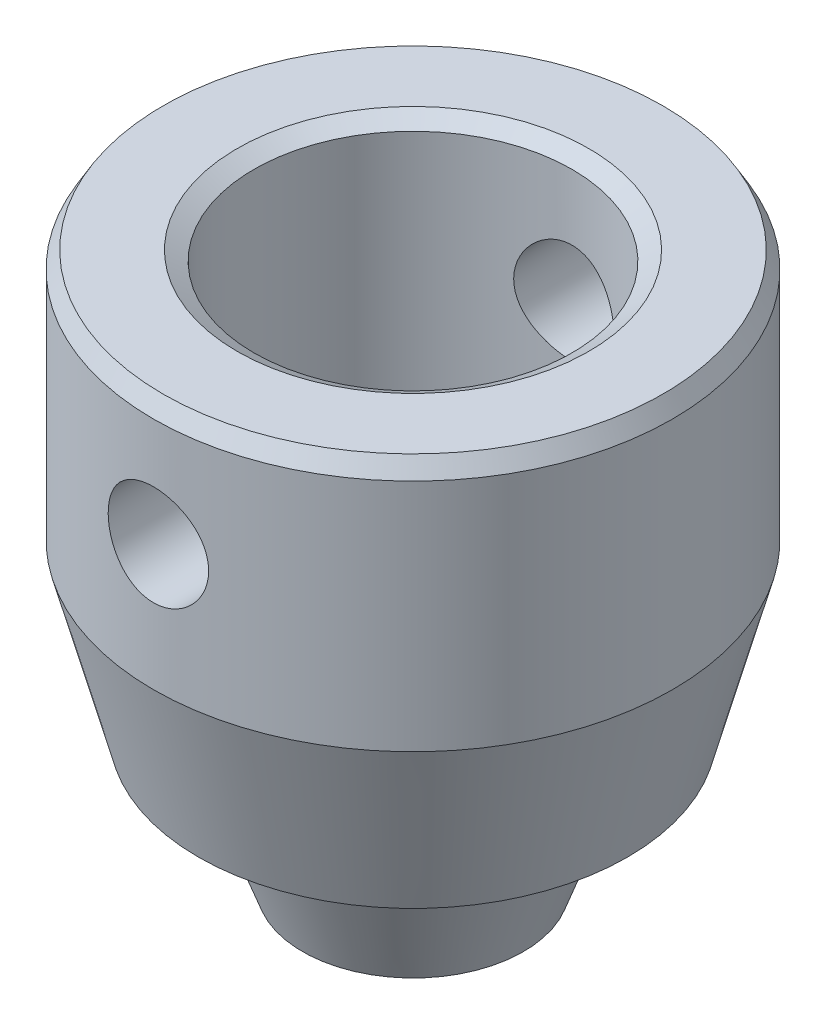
ISO-10303-21;
HEADER;
FILE_DESCRIPTION(('STEP AP214'),'2;1');
FILE_NAME('part.step','',(''),(''),'','','');
FILE_SCHEMA(('AUTOMOTIVE_DESIGN { 1 0 10303 214 1 1 1 1 }'));
ENDSEC;
DATA;
#1=APPLICATION_CONTEXT('core data for automotive mechanical design processes');
#2=APPLICATION_PROTOCOL_DEFINITION('international standard','automotive_design',2000,#1);
#3=PRODUCT_CONTEXT('',#1,'mechanical');
#4=PRODUCT('Part','Part','',(#3));
#5=PRODUCT_RELATED_PRODUCT_CATEGORY('part','',(#4));
#6=PRODUCT_DEFINITION_FORMATION('','',#4);
#7=PRODUCT_DEFINITION_CONTEXT('part definition',#1,'design');
#8=PRODUCT_DEFINITION('design','',#6,#7);
#9=PRODUCT_DEFINITION_SHAPE('','',#8);
#10=(LENGTH_UNIT() NAMED_UNIT(*) SI_UNIT(.MILLI.,.METRE.));
#11=(NAMED_UNIT(*) PLANE_ANGLE_UNIT() SI_UNIT($,.RADIAN.));
#12=(NAMED_UNIT(*) SI_UNIT($,.STERADIAN.) SOLID_ANGLE_UNIT());
#13=UNCERTAINTY_MEASURE_WITH_UNIT(LENGTH_MEASURE(1.E-05),#10,'distance_accuracy_value','');
#14=(GEOMETRIC_REPRESENTATION_CONTEXT(3) GLOBAL_UNCERTAINTY_ASSIGNED_CONTEXT((#13)) GLOBAL_UNIT_ASSIGNED_CONTEXT((#10,
#11,#12)) REPRESENTATION_CONTEXT('',''));
#15=CARTESIAN_POINT('',(0.,0.,0.));
#16=DIRECTION('',(0.,0.,1.));
#17=DIRECTION('',(1.,0.,0.));
#18=AXIS2_PLACEMENT_3D('',#15,#16,#17);
#19=CARTESIAN_POINT('',(0.,25.,0.));
#20=DIRECTION('',(0.,-1.,0.));
#21=DIRECTION('',(0.,0.,-1.));
#22=AXIS2_PLACEMENT_3D('',#19,#20,#21);
#23=CYLINDRICAL_SURFACE('',#22,15.5);
#24=CARTESIAN_POINT('',(0.,20.5,-15.5));
#25=CARTESIAN_POINT('',(-0.166842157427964,20.4999937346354,-15.4999969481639));
#26=CARTESIAN_POINT('',(-0.333764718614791,20.4860348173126,-15.4972784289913));
#27=CARTESIAN_POINT('',(-0.662899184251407,20.4306079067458,-15.4866958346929));
#28=CARTESIAN_POINT('',(-0.825107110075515,20.3891173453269,-15.4788275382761));
#29=CARTESIAN_POINT('',(-1.14000531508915,20.2799507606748,-15.4588248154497));
#30=CARTESIAN_POINT('',(-1.29270428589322,20.2122990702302,-15.4466943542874));
#31=CARTESIAN_POINT('',(-1.58457198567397,20.052801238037,-15.4194891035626));
#32=CARTESIAN_POINT('',(-1.72374167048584,19.9609568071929,-15.4044145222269));
#33=CARTESIAN_POINT('',(-1.9863833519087,19.7544409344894,-15.3727681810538));
#34=CARTESIAN_POINT('',(-2.10965836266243,19.6395212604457,-15.3561813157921));
#35=CARTESIAN_POINT('',(-2.33530650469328,19.3906508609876,-15.3234909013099));
#36=CARTESIAN_POINT('',(-2.4376780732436,19.2566987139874,-15.3073873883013));
#37=CARTESIAN_POINT('',(-2.61944182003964,18.9721618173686,-15.2773398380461));
#38=CARTESIAN_POINT('',(-2.69863190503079,18.8214457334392,-15.2634152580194));
#39=CARTESIAN_POINT('',(-2.83049059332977,18.5085337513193,-15.2395158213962));
#40=CARTESIAN_POINT('',(-2.88316164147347,18.3463389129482,-15.2295406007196));
#41=CARTESIAN_POINT('',(-2.95985143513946,18.0171868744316,-15.2148217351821));
#42=CARTESIAN_POINT('',(-2.98421471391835,17.8503128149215,-15.2100152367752));
#43=CARTESIAN_POINT('',(-3.0046671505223,17.5147817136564,-15.2059886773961));
#44=CARTESIAN_POINT('',(-3.00075901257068,17.346124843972,-15.2067680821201));
#45=CARTESIAN_POINT('',(-2.96505853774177,17.0143234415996,-15.2137680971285));
#46=CARTESIAN_POINT('',(-2.93365948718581,16.8511347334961,-15.2199119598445));
#47=CARTESIAN_POINT('',(-2.84448853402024,16.532385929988,-15.2368279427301));
#48=CARTESIAN_POINT('',(-2.78671544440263,16.3768261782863,-15.2476002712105));
#49=CARTESIAN_POINT('',(-2.64605609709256,16.0766085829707,-15.2726388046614));
#50=CARTESIAN_POINT('',(-2.56301242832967,15.9320263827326,-15.2869267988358));
#51=CARTESIAN_POINT('',(-2.37428042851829,15.6587010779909,-15.3173725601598));
#52=CARTESIAN_POINT('',(-2.26858965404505,15.5299596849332,-15.3335305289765));
#53=CARTESIAN_POINT('',(-2.03545019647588,15.2896995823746,-15.3662291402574));
#54=CARTESIAN_POINT('',(-1.90766546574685,15.1785069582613,-15.3827716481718));
#55=CARTESIAN_POINT('',(-1.63508621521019,14.9790855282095,-15.4141260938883));
#56=CARTESIAN_POINT('',(-1.49029150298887,14.8908569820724,-15.4289380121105));
#57=CARTESIAN_POINT('',(-1.18745182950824,14.7398143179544,-15.4551953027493));
#58=CARTESIAN_POINT('',(-1.02938872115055,14.6770357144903,-15.4666359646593));
#59=CARTESIAN_POINT('',(-0.704689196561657,14.5790132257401,-15.4848256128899));
#60=CARTESIAN_POINT('',(-0.538053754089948,14.5437662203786,-15.4915751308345));
#61=CARTESIAN_POINT('',(-0.203743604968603,14.5022650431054,-15.4995484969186));
#62=CARTESIAN_POINT('',(-0.0361262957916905,14.4955643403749,-15.5008574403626));
#63=CARTESIAN_POINT('',(0.297833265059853,14.5101459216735,-15.4980378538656));
#64=CARTESIAN_POINT('',(0.46417558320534,14.5314267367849,-15.4939096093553));
#65=CARTESIAN_POINT('',(0.789435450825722,14.6009961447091,-15.4807326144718));
#66=CARTESIAN_POINT('',(0.948403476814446,14.6490572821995,-15.4717253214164));
#67=CARTESIAN_POINT('',(1.25602495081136,14.7705757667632,-15.4497962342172));
#68=CARTESIAN_POINT('',(1.40467766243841,14.8440349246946,-15.4368741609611));
#69=CARTESIAN_POINT('',(1.68934378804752,15.0152418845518,-15.4083367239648));
#70=CARTESIAN_POINT('',(1.8251912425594,15.1132606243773,-15.3926919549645));
#71=CARTESIAN_POINT('',(2.07866993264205,15.3304395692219,-15.3605171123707));
#72=CARTESIAN_POINT('',(2.19629934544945,15.4496018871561,-15.3439869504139));
#73=CARTESIAN_POINT('',(2.41171234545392,15.707712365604,-15.3116199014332));
#74=CARTESIAN_POINT('',(2.50919032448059,15.846917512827,-15.2957961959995));
#75=CARTESIAN_POINT('',(2.67938023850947,16.1399884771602,-15.2669055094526));
#76=CARTESIAN_POINT('',(2.75209312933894,16.2938537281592,-15.2538384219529));
#77=CARTESIAN_POINT('',(2.87026314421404,16.6111258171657,-15.2320453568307));
#78=CARTESIAN_POINT('',(2.91585659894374,16.7744803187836,-15.2232977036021));
#79=CARTESIAN_POINT('',(2.97891074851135,17.1067176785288,-15.2110861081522));
#80=CARTESIAN_POINT('',(2.99637485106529,17.2755998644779,-15.2076215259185));
#81=CARTESIAN_POINT('',(3.00255473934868,17.6110341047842,-15.2064022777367));
#82=CARTESIAN_POINT('',(2.99175298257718,17.7775771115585,-15.208551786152));
#83=CARTESIAN_POINT('',(2.94276810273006,18.1064248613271,-15.218105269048));
#84=CARTESIAN_POINT('',(2.90458516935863,18.2687296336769,-15.2255092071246));
#85=CARTESIAN_POINT('',(2.80213097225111,18.5842115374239,-15.2446957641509));
#86=CARTESIAN_POINT('',(2.73791525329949,18.7374073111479,-15.2564690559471));
#87=CARTESIAN_POINT('',(2.58527230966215,19.0309268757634,-15.2830737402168));
#88=CARTESIAN_POINT('',(2.49684322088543,19.171249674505,-15.2979053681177));
#89=CARTESIAN_POINT('',(2.29662044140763,19.4374499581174,-15.3292510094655));
#90=CARTESIAN_POINT('',(2.18447690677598,19.5630616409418,-15.3457880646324));
#91=CARTESIAN_POINT('',(1.94073471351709,19.7938442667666,-15.3785122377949));
#92=CARTESIAN_POINT('',(1.80913159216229,19.8990105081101,-15.394699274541));
#93=CARTESIAN_POINT('',(1.52867568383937,20.0868740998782,-15.4250840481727));
#94=CARTESIAN_POINT('',(1.37966809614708,20.1693438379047,-15.4392609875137));
#95=CARTESIAN_POINT('',(1.06968135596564,20.3079444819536,-15.4638244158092));
#96=CARTESIAN_POINT('',(0.908713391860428,20.3640996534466,-15.4742143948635));
#97=CARTESIAN_POINT('',(0.622770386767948,20.4373250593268,-15.4879623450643));
#98=CARTESIAN_POINT('',(0.499446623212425,20.4607871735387,-15.492450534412));
#99=CARTESIAN_POINT('',(0.250763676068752,20.4921267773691,-15.4984704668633));
#100=CARTESIAN_POINT('',(0.125404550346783,20.5000047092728,-15.5000022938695));
#101=CARTESIAN_POINT('',(0.,20.5,-15.5));
#102=B_SPLINE_CURVE_WITH_KNOTS('',3,(#24,#25,#26,#27,#28,#29,#30,#31,#32,#33,#34,#35,#36,#37,
#38,#39,#40,#41,#42,#43,#44,#45,#46,#47,#48,#49,#50,#51,#52,#53,#54,#55,#56,#57,#58,#59,#60,#61,
#62,#63,#64,#65,#66,#67,#68,#69,#70,#71,#72,#73,#74,#75,#76,#77,#78,#79,#80,#81,#82,#83,#84,#85,
#86,#87,#88,#89,#90,#91,#92,#93,#94,#95,#96,#97,#98,#99,#100,#101),.UNSPECIFIED.,.T.,.F.,(4,2,2,
2,2,2,2,2,2,2,2,2,2,2,2,2,2,2,2,2,2,2,2,2,2,2,2,2,2,2,2,2,2,2,2,2,2,2,4),(0.,0.500067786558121,
1.0005459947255,1.50055981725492,2.00053828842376,2.5062150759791,3.0119296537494,
3.52192995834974,4.03188323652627,4.53556262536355,5.0391938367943,5.53573568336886,
6.03229987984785,6.53202279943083,7.03179966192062,7.53998224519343,8.0481705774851,
8.55706564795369,9.06590303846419,9.56675110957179,10.0675728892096,10.564204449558,
11.0608714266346,11.5632793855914,12.065737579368,12.5753323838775,13.0849075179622,
13.5918988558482,14.0988287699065,14.5971627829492,15.0954933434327,15.5927661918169,
16.090077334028,16.5953127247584,17.1006641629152,17.6109127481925,18.1206898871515,
18.4965694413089,18.8724383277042),.UNSPECIFIED.);
#103=CARTESIAN_POINT('',(0.,20.5,-15.5));
#104=VERTEX_POINT('',#103);
#105=EDGE_CURVE('E80',#104,#104,#102,.T.);
#106=ORIENTED_EDGE('',*,*,#105,.T.);
#107=EDGE_LOOP('',(#106));
#108=FACE_BOUND('',#107,.T.);
#109=CARTESIAN_POINT('',(3.,17.5,15.2069063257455));
#110=CARTESIAN_POINT('',(2.99999370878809,17.333190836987,15.2069096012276));
#111=CARTESIAN_POINT('',(2.98604012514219,17.166301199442,15.2096808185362));
#112=CARTESIAN_POINT('',(2.9306363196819,16.8372350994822,15.2204512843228));
#113=CARTESIAN_POINT('',(2.88916340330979,16.6750626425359,15.2284548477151));
#114=CARTESIAN_POINT('',(2.78004840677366,16.360239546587,15.2487503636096));
#115=CARTESIAN_POINT('',(2.71243148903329,16.2075799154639,15.2610381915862));
#116=CARTESIAN_POINT('',(2.55301562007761,15.9157785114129,15.2885128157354));
#117=CARTESIAN_POINT('',(2.46121829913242,15.7766358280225,15.3036994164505));
#118=CARTESIAN_POINT('',(2.25475067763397,15.513965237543,15.3354852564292));
#119=CARTESIAN_POINT('',(2.13982156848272,15.3906425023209,15.3520991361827));
#120=CARTESIAN_POINT('',(1.89091205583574,15.164901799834,15.3847384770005));
#121=CARTESIAN_POINT('',(1.75693036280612,15.0624852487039,15.4007638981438));
#122=CARTESIAN_POINT('',(1.47236601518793,14.8806731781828,15.4305780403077));
#123=CARTESIAN_POINT('',(1.32165710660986,14.8014718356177,15.4443474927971));
#124=CARTESIAN_POINT('',(1.00876065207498,14.6695903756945,15.4679340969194));
#125=CARTESIAN_POINT('',(0.846574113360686,14.6169079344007,15.4777515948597));
#126=CARTESIAN_POINT('',(0.517453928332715,14.540196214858,15.4922247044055));
#127=CARTESIAN_POINT('',(0.350603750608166,14.5158207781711,15.4969426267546));
#128=CARTESIAN_POINT('',(0.0151198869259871,14.4953357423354,15.5008999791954));
#129=CARTESIAN_POINT('',(-0.153513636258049,14.4992235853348,15.5001399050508));
#130=CARTESIAN_POINT('',(-0.48540113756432,14.5348906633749,15.4932754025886));
#131=CARTESIAN_POINT('',(-0.648696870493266,14.5662971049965,15.4872424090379));
#132=CARTESIAN_POINT('',(-0.96765585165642,14.655519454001,15.4705902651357));
#133=CARTESIAN_POINT('',(-1.12331880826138,14.7133363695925,15.4599709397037));
#134=CARTESIAN_POINT('',(-1.42366636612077,14.8540889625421,15.4352207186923));
#135=CARTESIAN_POINT('',(-1.56828003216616,14.937172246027,15.4210692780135));
#136=CARTESIAN_POINT('',(-1.84165173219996,15.1259901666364,15.3908174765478));
#137=CARTESIAN_POINT('',(-1.97040805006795,15.2317272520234,15.3747169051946));
#138=CARTESIAN_POINT('',(-2.21062063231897,15.464901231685,15.3420375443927));
#139=CARTESIAN_POINT('',(-2.32176000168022,15.5926643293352,15.3254552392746));
#140=CARTESIAN_POINT('',(-2.52108405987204,15.8651807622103,15.2939317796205));
#141=CARTESIAN_POINT('',(-2.60926836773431,16.0099343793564,15.2789906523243));
#142=CARTESIAN_POINT('',(-2.7602784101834,16.3127596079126,15.2524352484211));
#143=CARTESIAN_POINT('',(-2.82305559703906,16.4708560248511,15.2408273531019));
#144=CARTESIAN_POINT('',(-2.92106520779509,16.7956284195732,15.222348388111));
#145=CARTESIAN_POINT('',(-2.95630097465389,16.9623033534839,15.2154767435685));
#146=CARTESIAN_POINT('',(-2.99775964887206,17.2966369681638,15.2073627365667));
#147=CARTESIAN_POINT('',(-3.0044389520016,17.4642369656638,15.2060318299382));
#148=CARTESIAN_POINT('',(-2.98982075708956,17.798156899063,15.2089126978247));
#149=CARTESIAN_POINT('',(-2.96852473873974,17.9644769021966,15.2131241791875));
#150=CARTESIAN_POINT('',(-2.8989530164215,18.2895992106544,15.2265326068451));
#151=CARTESIAN_POINT('',(-2.85091875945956,18.4484551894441,15.2356849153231));
#152=CARTESIAN_POINT('',(-2.72949120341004,18.7558643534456,15.2579049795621));
#153=CARTESIAN_POINT('',(-2.65609592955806,18.9044167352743,15.2709730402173));
#154=CARTESIAN_POINT('',(-2.4849875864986,19.1890060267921,15.2997525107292));
#155=CARTESIAN_POINT('',(-2.38698750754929,19.3248672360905,15.3154943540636));
#156=CARTESIAN_POINT('',(-2.16983631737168,19.5783822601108,15.3477630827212));
#157=CARTESIAN_POINT('',(-2.05068317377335,19.6960343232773,15.3642900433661));
#158=CARTESIAN_POINT('',(-1.79256478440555,19.9115084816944,15.396552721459));
#159=CARTESIAN_POINT('',(-1.65334051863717,20.0090228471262,15.4122737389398));
#160=CARTESIAN_POINT('',(-1.36022043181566,20.1792765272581,15.4409019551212));
#161=CARTESIAN_POINT('',(-1.20632520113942,20.2520168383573,15.45380926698));
#162=CARTESIAN_POINT('',(-0.889062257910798,20.3702026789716,15.4752927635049));
#163=CARTESIAN_POINT('',(-0.72575136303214,20.4157962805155,15.4838924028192));
#164=CARTESIAN_POINT('',(-0.393606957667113,20.4788654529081,15.4958919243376));
#165=CARTESIAN_POINT('',(-0.224774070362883,20.496344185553,15.4992923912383));
#166=CARTESIAN_POINT('',(0.110676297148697,20.5025714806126,15.5004977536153));
#167=CARTESIAN_POINT('',(0.277285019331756,20.4917838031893,15.4983929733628));
#168=CARTESIAN_POINT('',(0.606267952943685,20.442804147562,15.4890130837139));
#169=CARTESIAN_POINT('',(0.768642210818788,20.4046124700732,15.4817380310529));
#170=CARTESIAN_POINT('',(1.0842809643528,20.3021095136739,15.4628362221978));
#171=CARTESIAN_POINT('',(1.23756303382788,20.2378506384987,15.4512182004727));
#172=CARTESIAN_POINT('',(1.53123752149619,20.0850943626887,15.4248849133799));
#173=CARTESIAN_POINT('',(1.67162900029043,19.996595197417,15.4101694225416));
#174=CARTESIAN_POINT('',(1.93783962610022,19.7962893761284,15.378980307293));
#175=CARTESIAN_POINT('',(2.06340512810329,19.6841492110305,15.3624833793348));
#176=CARTESIAN_POINT('',(2.29409614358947,19.4404335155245,15.3297335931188));
#177=CARTESIAN_POINT('',(2.39921682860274,19.3088534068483,15.3134807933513));
#178=CARTESIAN_POINT('',(2.58702400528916,19.0284217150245,15.2828817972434));
#179=CARTESIAN_POINT('',(2.66947645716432,18.8794110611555,15.2685562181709));
#180=CARTESIAN_POINT('',(2.80804396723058,18.5694192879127,15.2436834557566));
#181=CARTESIAN_POINT('',(2.86418342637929,18.4084494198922,15.2331327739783));
#182=CARTESIAN_POINT('',(2.93737033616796,18.1225468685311,15.2191597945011));
#183=CARTESIAN_POINT('',(2.9608153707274,17.9992679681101,15.2145925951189));
#184=CARTESIAN_POINT('',(2.99213232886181,17.7506744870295,15.2084646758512));
#185=CARTESIAN_POINT('',(3.00000472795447,17.6253599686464,15.2069038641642));
#186=CARTESIAN_POINT('',(3.,17.5,15.2069063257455));
#187=B_SPLINE_CURVE_WITH_KNOTS('',3,(#109,#110,#111,#112,#113,#114,#115,#116,#117,#118,#119,
#120,#121,#122,#123,#124,#125,#126,#127,#128,#129,#130,#131,#132,#133,#134,#135,#136,#137,#138,
#139,#140,#141,#142,#143,#144,#145,#146,#147,#148,#149,#150,#151,#152,#153,#154,#155,#156,#157,
#158,#159,#160,#161,#162,#163,#164,#165,#166,#167,#168,#169,#170,#171,#172,#173,#174,#175,#176,
#177,#178,#179,#180,#181,#182,#183,#184,#185,#186),.UNSPECIFIED.,.T.,.F.,(4,2,2,2,2,2,2,2,2,2,2,
2,2,2,2,2,2,2,2,2,2,2,2,2,2,2,2,2,2,2,2,2,2,2,2,2,2,2,4),(0.,0.499968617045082,1.00035005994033,
1.50025110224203,2.00011844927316,2.50592502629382,3.01176585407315,3.52172421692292,
4.03163788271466,4.53524801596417,5.03881257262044,5.53565903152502,6.03252445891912,
6.53235022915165,7.03223004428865,7.54027405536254,8.04832649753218,8.55734519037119,
9.06630208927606,9.56709358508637,10.0678585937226,10.5641733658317,11.0605267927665,
11.5629634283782,12.0654483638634,12.5751210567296,13.0847732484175,13.5916194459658,
14.0984086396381,14.5969353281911,15.0954565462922,15.5929804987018,16.0905406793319,
16.5956561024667,17.1008906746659,17.6111608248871,18.1209568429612,18.49670337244,
18.8724384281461),.UNSPECIFIED.);
#188=CARTESIAN_POINT('',(3.,17.5,15.2069063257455));
#189=VERTEX_POINT('',#188);
#190=EDGE_CURVE('E54',#189,#189,#187,.T.);
#191=ORIENTED_EDGE('',*,*,#190,.T.);
#192=EDGE_LOOP('',(#191));
#193=FACE_BOUND('',#192,.T.);
#194=CARTESIAN_POINT('',(0.,24.,0.));
#195=DIRECTION('',(0.,1.,0.));
#196=DIRECTION('',(0.,0.,1.));
#197=AXIS2_PLACEMENT_3D('',#194,#195,#196);
#198=CIRCLE('',#197,15.5);
#199=CARTESIAN_POINT('',(0.,24.,15.5));
#200=VERTEX_POINT('',#199);
#201=EDGE_CURVE('E100',#200,#200,#198,.F.);
#202=ORIENTED_EDGE('',*,*,#201,.T.);
#203=EDGE_LOOP('',(#202));
#204=FACE_BOUND('',#203,.T.);
#205=CARTESIAN_POINT('',(0.,10.,0.));
#206=DIRECTION('',(0.,1.,0.));
#207=DIRECTION('',(0.,0.,1.));
#208=AXIS2_PLACEMENT_3D('',#205,#206,#207);
#209=CIRCLE('',#208,15.5);
#210=CARTESIAN_POINT('',(0.,10.,15.5));
#211=VERTEX_POINT('',#210);
#212=EDGE_CURVE('E91',#211,#211,#209,.T.);
#213=ORIENTED_EDGE('',*,*,#212,.T.);
#214=EDGE_LOOP('',(#213));
#215=FACE_BOUND('',#214,.T.);
#216=ADVANCED_FACE('F29',(#108,#193,#204,#215),#23,.T.);
#217=CARTESIAN_POINT('',(0.,25.,0.));
#218=DIRECTION('',(0.,1.,0.));
#219=DIRECTION('',(0.,0.,1.));
#220=AXIS2_PLACEMENT_3D('',#217,#218,#219);
#221=PLANE('',#220);
#222=CARTESIAN_POINT('',(0.,25.,0.));
#223=DIRECTION('',(0.,1.,0.));
#224=DIRECTION('',(0.,0.,1.));
#225=AXIS2_PLACEMENT_3D('',#222,#223,#224);
#226=CIRCLE('',#225,10.5);
#227=CARTESIAN_POINT('',(0.,25.,10.5));
#228=VERTEX_POINT('',#227);
#229=EDGE_CURVE('E40',#228,#228,#226,.F.);
#230=ORIENTED_EDGE('',*,*,#229,.T.);
#231=EDGE_LOOP('',(#230));
#232=FACE_BOUND('',#231,.T.);
#233=CARTESIAN_POINT('',(0.,25.,0.));
#234=DIRECTION('',(0.,1.,0.));
#235=DIRECTION('',(0.,0.,1.));
#236=AXIS2_PLACEMENT_3D('',#233,#234,#235);
#237=CIRCLE('',#236,14.9226497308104);
#238=CARTESIAN_POINT('',(0.,25.,14.9226497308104));
#239=VERTEX_POINT('',#238);
#240=EDGE_CURVE('E97',#239,#239,#237,.T.);
#241=ORIENTED_EDGE('',*,*,#240,.T.);
#242=EDGE_LOOP('',(#241));
#243=FACE_BOUND('',#242,.T.);
#244=ADVANCED_FACE('F117',(#232,#243),#221,.T.);
#245=CARTESIAN_POINT('',(0.,0.,0.));
#246=DIRECTION('',(0.,1.,0.));
#247=DIRECTION('',(0.,0.,1.));
#248=AXIS2_PLACEMENT_3D('',#245,#246,#247);
#249=PLANE('',#248);
#250=CARTESIAN_POINT('',(0.,0.,0.));
#251=DIRECTION('',(0.,1.,0.));
#252=DIRECTION('',(0.,0.,1.));
#253=AXIS2_PLACEMENT_3D('',#250,#251,#252);
#254=CIRCLE('',#253,10.2119694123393);
#255=CARTESIAN_POINT('',(0.,0.,10.2119694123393));
#256=VERTEX_POINT('',#255);
#257=EDGE_CURVE('E10',#256,#256,#254,.T.);
#258=ORIENTED_EDGE('',*,*,#257,.T.);
#259=EDGE_LOOP('',(#258));
#260=FACE_BOUND('',#259,.T.);
#261=CARTESIAN_POINT('',(0.,0.,0.));
#262=DIRECTION('',(0.,1.,0.));
#263=DIRECTION('',(0.,0.,1.));
#264=AXIS2_PLACEMENT_3D('',#261,#262,#263);
#265=CIRCLE('',#264,12.8205080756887);
#266=CARTESIAN_POINT('',(0.,0.,12.8205080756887));
#267=VERTEX_POINT('',#266);
#268=EDGE_CURVE('E94',#267,#267,#265,.F.);
#269=ORIENTED_EDGE('',*,*,#268,.T.);
#270=EDGE_LOOP('',(#269));
#271=FACE_BOUND('',#270,.T.);
#272=ADVANCED_FACE('F122',(#260,#271),#249,.F.);
#273=CARTESIAN_POINT('',(0.,10.,0.));
#274=DIRECTION('',(0.,1.,0.));
#275=DIRECTION('',(0.,0.,1.));
#276=AXIS2_PLACEMENT_3D('',#273,#274,#275);
#277=CONICAL_SURFACE('',#276,15.5,0.261799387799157);
#278=ORIENTED_EDGE('',*,*,#268,.F.);
#279=EDGE_LOOP('',(#278));
#280=FACE_BOUND('',#279,.T.);
#281=ORIENTED_EDGE('',*,*,#212,.F.);
#282=EDGE_LOOP('',(#281));
#283=FACE_BOUND('',#282,.T.);
#284=ADVANCED_FACE('F132',(#280,#283),#277,.T.);
#285=CARTESIAN_POINT('',(0.,25.,0.));
#286=DIRECTION('',(0.,-1.,0.));
#287=DIRECTION('',(0.,0.,-1.));
#288=AXIS2_PLACEMENT_3D('',#285,#286,#287);
#289=CONICAL_SURFACE('',#288,14.9226497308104,0.523598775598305);
#290=ORIENTED_EDGE('',*,*,#201,.F.);
#291=EDGE_LOOP('',(#290));
#292=FACE_BOUND('',#291,.T.);
#293=ORIENTED_EDGE('',*,*,#240,.F.);
#294=EDGE_LOOP('',(#293));
#295=FACE_BOUND('',#294,.T.);
#296=ADVANCED_FACE('F134',(#292,#295),#289,.T.);
#297=CARTESIAN_POINT('',(0.,9.,0.));
#298=DIRECTION('',(0.,1.,0.));
#299=DIRECTION('',(0.,0.,1.));
#300=AXIS2_PLACEMENT_3D('',#297,#298,#299);
#301=CYLINDRICAL_SURFACE('',#300,9.5);
#302=CARTESIAN_POINT('',(0.,14.5,9.5));
#303=CARTESIAN_POINT('',(0.164167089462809,14.5000008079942,9.49999935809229));
#304=CARTESIAN_POINT('',(0.328342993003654,14.5135197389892,9.49570457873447));
#305=CARTESIAN_POINT('',(0.651888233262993,14.5670928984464,9.47899296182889));
#306=CARTESIAN_POINT('',(0.811256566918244,14.6071526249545,9.46657444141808));
#307=CARTESIAN_POINT('',(1.12047453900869,14.712317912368,9.43497086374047));
#308=CARTESIAN_POINT('',(1.2703386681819,14.7773842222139,9.4157964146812));
#309=CARTESIAN_POINT('',(1.55702915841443,14.9305470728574,9.37265725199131));
#310=CARTESIAN_POINT('',(1.69385337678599,15.0186473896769,9.34869175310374));
#311=CARTESIAN_POINT('',(1.954886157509,15.2182946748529,9.29766753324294));
#312=CARTESIAN_POINT('',(2.07862693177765,15.3304356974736,9.27054036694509));
#313=CARTESIAN_POINT('',(2.30589485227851,15.5737165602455,9.21664353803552));
#314=CARTESIAN_POINT('',(2.4094181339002,15.7048600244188,9.1898739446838));
#315=CARTESIAN_POINT('',(2.59586933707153,15.9864975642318,9.1389859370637));
#316=CARTESIAN_POINT('',(2.67820924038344,16.1373976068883,9.11495183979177));
#317=CARTESIAN_POINT('',(2.81614778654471,16.4517849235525,9.07328724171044));
#318=CARTESIAN_POINT('',(2.87175364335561,16.6152687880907,9.05565501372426));
#319=CARTESIAN_POINT('',(2.9529272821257,16.9448978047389,9.02950721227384));
#320=CARTESIAN_POINT('',(2.97936420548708,17.1108074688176,9.02072856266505));
#321=CARTESIAN_POINT('',(3.00416514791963,17.4449217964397,9.01250122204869));
#322=CARTESIAN_POINT('',(3.00253681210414,17.6131258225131,9.01304999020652));
#323=CARTESIAN_POINT('',(2.97193247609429,17.9398310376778,9.02318352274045));
#324=CARTESIAN_POINT('',(2.94406576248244,18.0984494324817,9.03240174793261));
#325=CARTESIAN_POINT('',(2.86357596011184,18.4086330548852,9.05823941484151));
#326=CARTESIAN_POINT('',(2.81095018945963,18.5601975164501,9.07485965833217));
#327=CARTESIAN_POINT('',(2.68166168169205,18.8545945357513,9.11390651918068));
#328=CARTESIAN_POINT('',(2.60465367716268,18.9972640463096,9.13641567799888));
#329=CARTESIAN_POINT('',(2.42902643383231,19.2680176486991,9.1846668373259));
#330=CARTESIAN_POINT('',(2.33040148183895,19.396097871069,9.21040969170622));
#331=CARTESIAN_POINT('',(2.10891443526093,19.640302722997,9.26369376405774));
#332=CARTESIAN_POINT('',(1.98513792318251,19.7555934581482,9.29126291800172));
#333=CARTESIAN_POINT('',(1.71966506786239,19.9639864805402,9.3440378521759));
#334=CARTESIAN_POINT('',(1.57796734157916,20.0570870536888,9.36924344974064));
#335=CARTESIAN_POINT('',(1.27904248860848,20.2190380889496,9.41472566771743));
#336=CARTESIAN_POINT('',(1.12169880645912,20.2876858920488,9.43496068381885));
#337=CARTESIAN_POINT('',(0.79690854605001,20.3972895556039,9.46792126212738));
#338=CARTESIAN_POINT('',(0.629465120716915,20.4382540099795,9.48064915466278));
#339=CARTESIAN_POINT('',(0.296303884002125,20.4898989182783,9.49678470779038));
#340=CARTESIAN_POINT('',(0.13077757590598,20.5017079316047,9.50053950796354));
#341=CARTESIAN_POINT('',(-0.199911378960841,20.4978937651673,9.49933471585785));
#342=CARTESIAN_POINT('',(-0.365074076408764,20.482274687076,9.49437642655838));
#343=CARTESIAN_POINT('',(-0.68596921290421,20.4249518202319,9.47653086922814));
#344=CARTESIAN_POINT('',(-0.84183470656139,20.3839228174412,9.46384885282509));
#345=CARTESIAN_POINT('',(-1.14442314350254,20.2777712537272,9.43204434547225));
#346=CARTESIAN_POINT('',(-1.29114494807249,20.2126456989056,9.41292105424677));
#347=CARTESIAN_POINT('',(-1.57531276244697,20.0583538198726,9.36960895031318));
#348=CARTESIAN_POINT('',(-1.71244019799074,19.9686334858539,9.34530669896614));
#349=CARTESIAN_POINT('',(-1.97006979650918,19.7683613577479,9.29441218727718));
#350=CARTESIAN_POINT('',(-2.09056734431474,19.6578038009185,9.26781929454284));
#351=CARTESIAN_POINT('',(-2.31658675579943,19.4136868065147,9.21398298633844));
#352=CARTESIAN_POINT('',(-2.42130400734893,19.2793768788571,9.186756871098));
#353=CARTESIAN_POINT('',(-2.60679013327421,18.9944999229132,9.13585946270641));
#354=CARTESIAN_POINT('',(-2.68755931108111,18.8439331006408,9.11218812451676));
#355=CARTESIAN_POINT('',(-2.8223709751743,18.5310761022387,9.07133925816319));
#356=CARTESIAN_POINT('',(-2.87651039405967,18.3688309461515,9.05413823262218));
#357=CARTESIAN_POINT('',(-2.95649944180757,18.0368703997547,9.0283393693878));
#358=CARTESIAN_POINT('',(-2.98236013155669,17.8671579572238,9.0197381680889));
#359=CARTESIAN_POINT('',(-3.00425241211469,17.5335061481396,9.01246833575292));
#360=CARTESIAN_POINT('',(-3.00160628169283,17.3696620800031,9.01335938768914));
#361=CARTESIAN_POINT('',(-2.96976166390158,17.0448766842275,9.02390107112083));
#362=CARTESIAN_POINT('',(-2.94056446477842,16.8839352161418,9.0335512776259));
#363=CARTESIAN_POINT('',(-2.8573397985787,16.571943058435,9.06021304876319));
#364=CARTESIAN_POINT('',(-2.80369834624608,16.4207788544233,9.07710994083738));
#365=CARTESIAN_POINT('',(-2.67341300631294,16.1294760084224,9.11632984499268));
#366=CARTESIAN_POINT('',(-2.59676436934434,15.9893396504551,9.13865397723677));
#367=CARTESIAN_POINT('',(-2.4190708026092,15.718026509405,9.18732235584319));
#368=CARTESIAN_POINT('',(-2.31717569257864,15.5874289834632,9.21379131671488));
#369=CARTESIAN_POINT('',(-2.0933684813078,15.3447583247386,9.26720162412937));
#370=CARTESIAN_POINT('',(-1.97145098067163,15.2326902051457,9.29414309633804));
#371=CARTESIAN_POINT('',(-1.7061326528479,15.0264861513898,9.34654886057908));
#372=CARTESIAN_POINT('',(-1.56214764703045,14.9330792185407,9.37193310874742));
#373=CARTESIAN_POINT('',(-1.25971894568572,14.771916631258,9.41734758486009));
#374=CARTESIAN_POINT('',(-1.10128066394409,14.7041514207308,9.43737980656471));
#375=CARTESIAN_POINT('',(-0.78727182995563,14.6008024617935,9.468532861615));
#376=CARTESIAN_POINT('',(-0.632450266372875,14.5631122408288,9.48022921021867));
#377=CARTESIAN_POINT('',(-0.318421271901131,14.5127132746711,9.49596227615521));
#378=CARTESIAN_POINT('',(-0.159214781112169,14.49999921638,9.50000062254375));
#379=CARTESIAN_POINT('',(0.,14.5,9.5));
#380=B_SPLINE_CURVE_WITH_KNOTS('',3,(#302,#303,#304,#305,#306,#307,#308,#309,#310,#311,#312,
#313,#314,#315,#316,#317,#318,#319,#320,#321,#322,#323,#324,#325,#326,#327,#328,#329,#330,#331,
#332,#333,#334,#335,#336,#337,#338,#339,#340,#341,#342,#343,#344,#345,#346,#347,#348,#349,#350,
#351,#352,#353,#354,#355,#356,#357,#358,#359,#360,#361,#362,#363,#364,#365,#366,#367,#368,#369,
#370,#371,#372,#373,#374,#375,#376,#377,#378,#379),.UNSPECIFIED.,.T.,.F.,(4,2,2,2,2,2,2,2,2,2,2,
2,2,2,2,2,2,2,2,2,2,2,2,2,2,2,2,2,2,2,2,2,2,2,2,2,2,2,4),(0.,0.49191594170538,0.983933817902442,
1.47518254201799,1.9665118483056,2.47177433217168,2.9771333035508,3.49529138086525,
4.0133095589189,4.51543663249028,5.01742692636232,5.49910423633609,5.98083373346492,
6.46971527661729,6.95872618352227,7.47049694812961,7.98230723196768,8.49826565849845,
9.01406383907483,9.50955937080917,10.0049808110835,10.487778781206,10.9706367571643,
11.4654198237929,11.9603399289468,12.4753133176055,12.9902801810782,13.5033584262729,
14.0162359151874,14.5054301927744,14.9946007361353,15.4763007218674,15.9581002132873,
16.4590917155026,16.9602185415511,17.4781824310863,17.9959530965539,18.4731312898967,
18.9502079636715),.UNSPECIFIED.);
#381=CARTESIAN_POINT('',(0.,14.5,9.5));
#382=VERTEX_POINT('',#381);
#383=EDGE_CURVE('E47',#382,#382,#380,.T.);
#384=ORIENTED_EDGE('',*,*,#383,.T.);
#385=EDGE_LOOP('',(#384));
#386=FACE_BOUND('',#385,.T.);
#387=CARTESIAN_POINT('',(3.,17.5,-9.01387818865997));
#388=CARTESIAN_POINT('',(2.99999916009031,17.3360634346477,-9.01387899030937));
#389=CARTESIAN_POINT('',(2.98651680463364,17.1721180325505,-9.0183994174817));
#390=CARTESIAN_POINT('',(2.93310209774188,16.8490499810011,-9.0359106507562));
#391=CARTESIAN_POINT('',(2.89316304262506,16.6899285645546,-9.04890360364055));
#392=CARTESIAN_POINT('',(2.78835016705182,16.3812355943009,-9.08174469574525));
#393=CARTESIAN_POINT('',(2.72352119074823,16.231647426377,-9.10158049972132));
#394=CARTESIAN_POINT('',(2.57091893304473,15.9454278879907,-9.14585503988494));
#395=CARTESIAN_POINT('',(2.48314143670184,15.8087989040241,-9.17029462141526));
#396=CARTESIAN_POINT('',(2.28383569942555,15.5475826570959,-9.2219846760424));
#397=CARTESIAN_POINT('',(2.1716406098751,15.4235168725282,-9.24929984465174));
#398=CARTESIAN_POINT('',(1.92811084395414,15.195611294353,-9.30311342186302));
#399=CARTESIAN_POINT('',(1.79677344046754,15.0917743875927,-9.32961171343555));
#400=CARTESIAN_POINT('',(1.51492967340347,14.9049629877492,-9.37954731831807));
#401=CARTESIAN_POINT('',(1.36405000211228,14.8225269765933,-9.40289959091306));
#402=CARTESIAN_POINT('',(1.04970413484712,14.6844054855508,-9.44315546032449));
#403=CARTESIAN_POINT('',(0.886240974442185,14.6287135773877,-9.46006060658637));
#404=CARTESIAN_POINT('',(0.556829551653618,14.5474065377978,-9.48505949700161));
#405=CARTESIAN_POINT('',(0.391121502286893,14.5208997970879,-9.49341386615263));
#406=CARTESIAN_POINT('',(0.057413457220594,14.4958889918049,-9.50129109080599));
#407=CARTESIAN_POINT('',(-0.110585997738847,14.4973784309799,-9.50081599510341));
#408=CARTESIAN_POINT('',(-0.43782723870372,14.5277343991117,-9.49126854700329));
#409=CARTESIAN_POINT('',(-0.597168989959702,14.5556340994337,-9.48249981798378));
#410=CARTESIAN_POINT('',(-0.908780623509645,14.6364303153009,-9.45772498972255));
#411=CARTESIAN_POINT('',(-1.06105004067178,14.6893284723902,-9.44171841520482));
#412=CARTESIAN_POINT('',(-1.35640730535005,14.8192323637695,-9.40386207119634));
#413=CARTESIAN_POINT('',(-1.49935802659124,14.8965286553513,-9.38194236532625));
#414=CARTESIAN_POINT('',(-1.7705582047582,15.072800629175,-9.33456499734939));
#415=CARTESIAN_POINT('',(-1.89880387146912,15.1717818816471,-9.3091064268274));
#416=CARTESIAN_POINT('',(-2.14271674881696,15.3935639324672,-9.25607979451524));
#417=CARTESIAN_POINT('',(-2.25761743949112,15.517198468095,-9.22846806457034));
#418=CARTESIAN_POINT('',(-2.46528602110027,15.7822363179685,-9.17517784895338));
#419=CARTESIAN_POINT('',(-2.55805118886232,15.9236418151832,-9.14949960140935));
#420=CARTESIAN_POINT('',(-2.71973277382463,16.2224135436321,-9.10276048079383));
#421=CARTESIAN_POINT('',(-2.78835927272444,16.3799462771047,-9.08175678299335));
#422=CARTESIAN_POINT('',(-2.8978668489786,16.705156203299,-9.04741397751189));
#423=CARTESIAN_POINT('',(-2.93875814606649,16.8728296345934,-9.03407204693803));
#424=CARTESIAN_POINT('',(-2.99014323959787,17.2062047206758,-9.01719187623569));
#425=CARTESIAN_POINT('',(-3.00181310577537,17.371706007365,-9.01327459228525));
#426=CARTESIAN_POINT('',(-2.99773027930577,17.7023154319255,-9.0146337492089));
#427=CARTESIAN_POINT('',(-2.98198193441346,17.8674236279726,-9.01990873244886));
#428=CARTESIAN_POINT('',(-2.92456169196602,18.1874533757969,-9.03868326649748));
#429=CARTESIAN_POINT('',(-2.88367438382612,18.3425318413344,-9.05193365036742));
#430=CARTESIAN_POINT('',(-2.77806113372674,18.6436078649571,-9.08490044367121));
#431=CARTESIAN_POINT('',(-2.71333124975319,18.7896039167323,-9.10461792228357));
#432=CARTESIAN_POINT('',(-2.5597174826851,19.0730834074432,-9.14901078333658));
#433=CARTESIAN_POINT('',(-2.47018428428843,19.2101944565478,-9.17381397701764));
#434=CARTESIAN_POINT('',(-2.27025997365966,19.4678740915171,-9.22532155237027));
#435=CARTESIAN_POINT('',(-2.15986332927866,19.5884382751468,-9.25202643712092));
#436=CARTESIAN_POINT('',(-1.91577207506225,19.814883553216,-9.30570026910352));
#437=CARTESIAN_POINT('',(-1.78128733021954,19.9199239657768,-9.33263229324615));
#438=CARTESIAN_POINT('',(-1.49594672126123,20.1059826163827,-9.38259511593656));
#439=CARTESIAN_POINT('',(-1.34509158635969,20.187001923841,-9.40562608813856));
#440=CARTESIAN_POINT('',(-1.03219857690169,20.3219447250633,-9.44506337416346));
#441=CARTESIAN_POINT('',(-0.870250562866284,20.376062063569,-9.46151690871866));
#442=CARTESIAN_POINT('',(-0.538938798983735,20.456106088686,-9.4861527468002));
#443=CARTESIAN_POINT('',(-0.369577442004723,20.4820418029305,-9.49433769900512));
#444=CARTESIAN_POINT('',(-0.0359772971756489,20.5042406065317,-9.5013348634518));
#445=CARTESIAN_POINT('',(0.128173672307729,20.5017168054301,-9.50053027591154));
#446=CARTESIAN_POINT('',(0.453606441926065,20.4700109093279,-9.49056058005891));
#447=CARTESIAN_POINT('',(0.614888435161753,20.4408306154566,-9.48139603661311));
#448=CARTESIAN_POINT('',(0.927939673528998,20.3574178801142,-9.45586049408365));
#449=CARTESIAN_POINT('',(1.07980534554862,20.3035161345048,-9.43958475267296));
#450=CARTESIAN_POINT('',(1.37240869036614,20.1724902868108,-9.40150455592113));
#451=CARTESIAN_POINT('',(1.51314443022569,20.0953621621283,-9.37969914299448));
#452=CARTESIAN_POINT('',(1.78476431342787,19.9170053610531,-9.33189674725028));
#453=CARTESIAN_POINT('',(1.91514277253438,19.8150386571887,-9.30578134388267));
#454=CARTESIAN_POINT('',(2.15734019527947,19.5911935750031,-9.25263675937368));
#455=CARTESIAN_POINT('',(2.26915352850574,19.4693091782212,-9.22560730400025));
#456=CARTESIAN_POINT('',(2.47489224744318,19.2041171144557,-9.17260032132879));
#457=CARTESIAN_POINT('',(2.56807911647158,19.0602214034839,-9.14668992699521));
#458=CARTESIAN_POINT('',(2.72885121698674,18.7580278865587,-9.10002290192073));
#459=CARTESIAN_POINT('',(2.79644626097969,18.59973562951,-9.07926429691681));
#460=CARTESIAN_POINT('',(2.89949801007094,18.2861070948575,-9.04685599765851));
#461=CARTESIAN_POINT('',(2.93707364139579,18.1315271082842,-9.03461574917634));
#462=CARTESIAN_POINT('',(2.98732180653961,17.8179667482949,-9.01812749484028));
#463=CARTESIAN_POINT('',(3.00000081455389,17.6589875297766,-9.01387741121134));
#464=CARTESIAN_POINT('',(3.,17.5,-9.01387818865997));
#465=B_SPLINE_CURVE_WITH_KNOTS('',3,(#387,#388,#389,#390,#391,#392,#393,#394,#395,#396,#397,
#398,#399,#400,#401,#402,#403,#404,#405,#406,#407,#408,#409,#410,#411,#412,#413,#414,#415,#416,
#417,#418,#419,#420,#421,#422,#423,#424,#425,#426,#427,#428,#429,#430,#431,#432,#433,#434,#435,
#436,#437,#438,#439,#440,#441,#442,#443,#444,#445,#446,#447,#448,#449,#450,#451,#452,#453,#454,
#455,#456,#457,#458,#459,#460,#461,#462,#463,#464),.UNSPECIFIED.,.T.,.F.,(4,2,2,2,2,2,2,2,2,2,2,
2,2,2,2,2,2,2,2,2,2,2,2,2,2,2,2,2,2,2,2,2,2,2,2,2,2,2,4),(0.,0.491222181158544,
0.982568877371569,1.47303443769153,1.96359014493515,2.46975467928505,2.97599139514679,
3.49394489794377,4.01177384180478,4.51330187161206,5.01471352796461,5.49845160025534,
5.98222144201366,6.47198487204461,6.96187425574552,7.47259002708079,7.98336859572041,
8.50008771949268,9.01661634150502,9.51199573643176,10.007296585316,10.487872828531,
10.9685285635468,11.4632008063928,11.9580044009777,12.4738149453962,12.9896025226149,
13.5016176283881,14.0134686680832,14.5035871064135,14.9936724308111,15.4773850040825,
15.9611814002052,16.461626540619,16.9622231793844,17.479861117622,17.9973003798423,
18.4738171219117,18.9502099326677),.UNSPECIFIED.);
#466=CARTESIAN_POINT('',(3.,17.5,-9.01387818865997));
#467=VERTEX_POINT('',#466);
#468=EDGE_CURVE('E55',#467,#467,#465,.T.);
#469=ORIENTED_EDGE('',*,*,#468,.T.);
#470=EDGE_LOOP('',(#469));
#471=FACE_BOUND('',#470,.T.);
#472=CARTESIAN_POINT('',(0.,24.4226497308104,0.));
#473=DIRECTION('',(0.,1.,0.));
#474=DIRECTION('',(0.,0.,1.));
#475=AXIS2_PLACEMENT_3D('',#472,#473,#474);
#476=CIRCLE('',#475,9.5);
#477=CARTESIAN_POINT('',(0.,24.4226497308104,9.5));
#478=VERTEX_POINT('',#477);
#479=EDGE_CURVE('E44',#478,#478,#476,.T.);
#480=ORIENTED_EDGE('',*,*,#479,.T.);
#481=EDGE_LOOP('',(#480));
#482=FACE_BOUND('',#481,.T.);
#483=CARTESIAN_POINT('',(0.,9.,0.));
#484=DIRECTION('',(0.,1.,0.));
#485=DIRECTION('',(0.,0.,1.));
#486=AXIS2_PLACEMENT_3D('',#483,#484,#485);
#487=CIRCLE('',#486,9.5);
#488=CARTESIAN_POINT('',(0.,9.,9.5));
#489=VERTEX_POINT('',#488);
#490=EDGE_CURVE('E88',#489,#489,#487,.T.);
#491=ORIENTED_EDGE('',*,*,#490,.F.);
#492=EDGE_LOOP('',(#491));
#493=FACE_BOUND('',#492,.T.);
#494=ADVANCED_FACE('F58',(#386,#471,#482,#493),#301,.F.);
#495=CARTESIAN_POINT('',(0.,9.,0.));
#496=DIRECTION('',(0.,1.,0.));
#497=DIRECTION('',(0.,0.,1.));
#498=AXIS2_PLACEMENT_3D('',#495,#496,#497);
#499=PLANE('',#498);
#500=ORIENTED_EDGE('',*,*,#490,.T.);
#501=EDGE_LOOP('',(#500));
#502=FACE_BOUND('',#501,.T.);
#503=ADVANCED_FACE('F176',(#502),#499,.T.);
#504=CARTESIAN_POINT('',(6.6,-8.,0.));
#505=DIRECTION('',(0.,-1.,0.));
#506=DIRECTION('',(0.,0.,-1.));
#507=AXIS2_PLACEMENT_3D('',#504,#505,#506);
#508=PLANE('',#507);
#509=CARTESIAN_POINT('',(0.,-8.,0.));
#510=DIRECTION('',(0.,-1.,0.));
#511=DIRECTION('',(0.,0.,-1.));
#512=AXIS2_PLACEMENT_3D('',#509,#510,#511);
#513=CIRCLE('',#512,6.6);
#514=CARTESIAN_POINT('',(0.,-8.,-6.6));
#515=VERTEX_POINT('',#514);
#516=EDGE_CURVE('E85',#515,#515,#513,.T.);
#517=ORIENTED_EDGE('',*,*,#516,.T.);
#518=EDGE_LOOP('',(#517));
#519=FACE_BOUND('',#518,.T.);
#520=ADVANCED_FACE('F114',(#519),#508,.T.);
#521=CARTESIAN_POINT('',(0.,-8.,0.));
#522=DIRECTION('',(0.,1.,0.));
#523=DIRECTION('',(0.,0.,1.));
#524=AXIS2_PLACEMENT_3D('',#521,#522,#523);
#525=CONICAL_SURFACE('',#524,6.6,0.34906585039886);
#526=CARTESIAN_POINT('',(0.,-0.657979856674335,0.));
#527=DIRECTION('',(0.,-1.,0.));
#528=DIRECTION('',(0.,0.,-1.));
#529=AXIS2_PLACEMENT_3D('',#526,#527,#528);
#530=CIRCLE('',#529,9.27227679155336);
#531=CARTESIAN_POINT('',(0.,-0.657979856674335,-9.27227679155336));
#532=VERTEX_POINT('',#531);
#533=EDGE_CURVE('E36',#532,#532,#530,.T.);
#534=ORIENTED_EDGE('',*,*,#533,.T.);
#535=EDGE_LOOP('',(#534));
#536=FACE_BOUND('',#535,.T.);
#537=ORIENTED_EDGE('',*,*,#516,.F.);
#538=EDGE_LOOP('',(#537));
#539=FACE_BOUND('',#538,.T.);
#540=ADVANCED_FACE('F109',(#536,#539),#525,.T.);
#541=CARTESIAN_POINT('',(0.,24.4226497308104,0.));
#542=DIRECTION('',(0.,1.,0.));
#543=DIRECTION('',(0.,0.,1.));
#544=AXIS2_PLACEMENT_3D('',#541,#542,#543);
#545=CONICAL_SURFACE('',#544,9.5,1.0471975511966);
#546=ORIENTED_EDGE('',*,*,#229,.F.);
#547=EDGE_LOOP('',(#546));
#548=FACE_BOUND('',#547,.T.);
#549=ORIENTED_EDGE('',*,*,#479,.F.);
#550=EDGE_LOOP('',(#549));
#551=FACE_BOUND('',#550,.T.);
#552=ADVANCED_FACE('F68',(#548,#551),#545,.F.);
#553=CARTESIAN_POINT('',(0.,17.5,-15.5));
#554=DIRECTION('',(0.,0.,1.));
#555=DIRECTION('',(1.,0.,0.));
#556=AXIS2_PLACEMENT_3D('',#553,#554,#555);
#557=CYLINDRICAL_SURFACE('',#556,3.);
#558=ORIENTED_EDGE('',*,*,#468,.F.);
#559=EDGE_LOOP('',(#558));
#560=FACE_BOUND('',#559,.T.);
#561=ORIENTED_EDGE('',*,*,#105,.F.);
#562=EDGE_LOOP('',(#561));
#563=FACE_BOUND('',#562,.T.);
#564=ADVANCED_FACE('F62',(#560,#563),#557,.F.);
#565=ORIENTED_EDGE('',*,*,#383,.F.);
#566=EDGE_LOOP('',(#565));
#567=FACE_BOUND('',#566,.T.);
#568=ORIENTED_EDGE('',*,*,#190,.F.);
#569=EDGE_LOOP('',(#568));
#570=FACE_BOUND('',#569,.T.);
#571=ADVANCED_FACE('F67',(#567,#570),#557,.F.);
#572=CARTESIAN_POINT('',(0.,-1.,0.));
#573=DIRECTION('',(0.,1.,0.));
#574=DIRECTION('',(0.,0.,1.));
#575=AXIS2_PLACEMENT_3D('',#572,#573,#574);
#576=TOROIDAL_SURFACE('',#575,10.2119694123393,1.);
#577=ORIENTED_EDGE('',*,*,#257,.F.);
#578=EDGE_LOOP('',(#577));
#579=FACE_BOUND('',#578,.T.);
#580=ORIENTED_EDGE('',*,*,#533,.F.);
#581=EDGE_LOOP('',(#580));
#582=FACE_BOUND('',#581,.T.);
#583=ADVANCED_FACE('F70',(#579,#582),#576,.F.);
#584=CLOSED_SHELL('',(#216,#244,#272,#284,#296,#494,#503,#520,#540,#552,#564,#571,#583));
#585=MANIFOLD_SOLID_BREP('B2',#584);
#586=ADVANCED_BREP_SHAPE_REPRESENTATION('',(#18,#585),#14);
#587=SHAPE_DEFINITION_REPRESENTATION(#9,#586);
ENDSEC;
END-ISO-10303-21;
